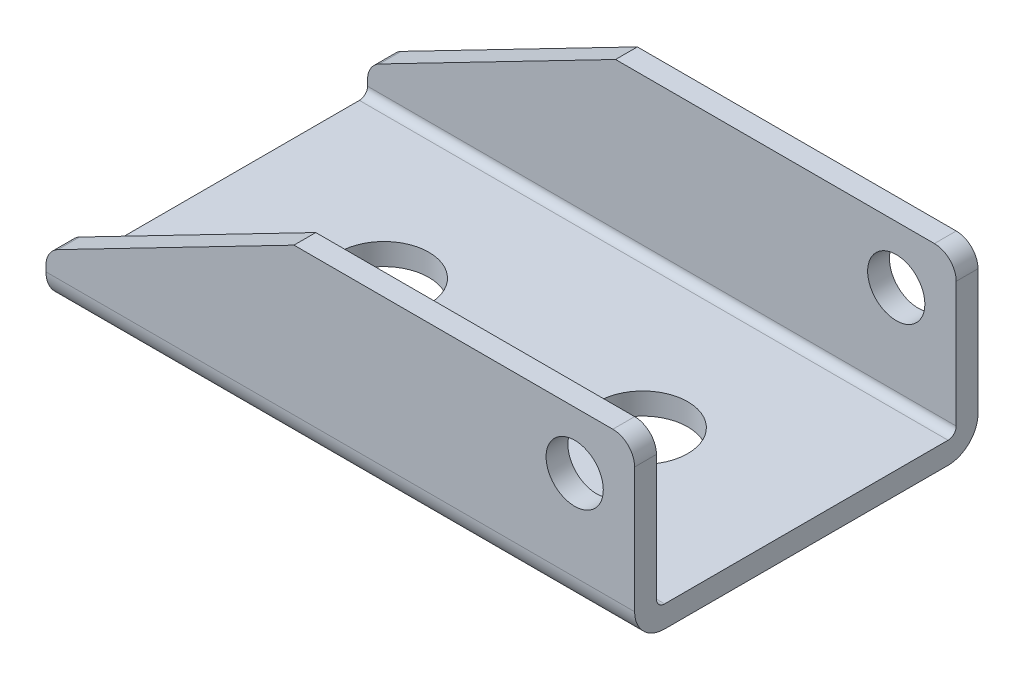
ISO-10303-21;
HEADER;
FILE_DESCRIPTION(('STEP AP214'),'2;1');
FILE_NAME('part.step','',(''),(''),'','','');
FILE_SCHEMA(('AUTOMOTIVE_DESIGN { 1 0 10303 214 1 1 1 1 }'));
ENDSEC;
DATA;
#1=APPLICATION_CONTEXT('core data for automotive mechanical design processes');
#2=APPLICATION_PROTOCOL_DEFINITION('international standard','automotive_design',2000,#1);
#3=PRODUCT_CONTEXT('',#1,'mechanical');
#4=PRODUCT('Part','Part','',(#3));
#5=PRODUCT_RELATED_PRODUCT_CATEGORY('part','',(#4));
#6=PRODUCT_DEFINITION_FORMATION('','',#4);
#7=PRODUCT_DEFINITION_CONTEXT('part definition',#1,'design');
#8=PRODUCT_DEFINITION('design','',#6,#7);
#9=PRODUCT_DEFINITION_SHAPE('','',#8);
#10=(LENGTH_UNIT() NAMED_UNIT(*) SI_UNIT(.MILLI.,.METRE.));
#11=(NAMED_UNIT(*) PLANE_ANGLE_UNIT() SI_UNIT($,.RADIAN.));
#12=(NAMED_UNIT(*) SI_UNIT($,.STERADIAN.) SOLID_ANGLE_UNIT());
#13=UNCERTAINTY_MEASURE_WITH_UNIT(LENGTH_MEASURE(1.E-05),#10,'distance_accuracy_value','');
#14=(GEOMETRIC_REPRESENTATION_CONTEXT(3) GLOBAL_UNCERTAINTY_ASSIGNED_CONTEXT((#13)) GLOBAL_UNIT_ASSIGNED_CONTEXT((#10,
#11,#12)) REPRESENTATION_CONTEXT('',''));
#15=CARTESIAN_POINT('',(0.,0.,0.));
#16=DIRECTION('',(0.,0.,1.));
#17=DIRECTION('',(1.,0.,0.));
#18=AXIS2_PLACEMENT_3D('',#15,#16,#17);
#19=CARTESIAN_POINT('',(-19.8859883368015,12.8779958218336,-6.30000000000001));
#20=DIRECTION('',(-0.458891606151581,0.888492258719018,0.));
#21=DIRECTION('',(-0.888492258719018,-0.458891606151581,0.));
#22=AXIS2_PLACEMENT_3D('',#19,#20,#21);
#23=PLANE('',#22);
#24=DIRECTION('',(0.,0.,-1.));
#25=VECTOR('',#24,1.);
#26=CARTESIAN_POINT('',(-28.5531016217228,8.40157467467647,0.));
#27=LINE('',#26,#25);
#28=CARTESIAN_POINT('',(-28.5531016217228,8.40157467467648,-5.50000000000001));
#29=VERTEX_POINT('',#28);
#30=CARTESIAN_POINT('',(-28.5531016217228,8.40157467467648,-6.30000000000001));
#31=VERTEX_POINT('',#30);
#32=EDGE_CURVE('E155',#29,#31,#27,.T.);
#33=ORIENTED_EDGE('',*,*,#32,.F.);
#34=DIRECTION('',(-0.888492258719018,-0.458891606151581,0.));
#35=VECTOR('',#34,1.);
#36=CARTESIAN_POINT('',(-19.8859883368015,12.8779958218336,-5.50000000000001));
#37=LINE('',#36,#35);
#38=CARTESIAN_POINT('',(-19.8859883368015,12.8779958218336,-5.50000000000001));
#39=VERTEX_POINT('',#38);
#40=EDGE_CURVE('E241',#29,#39,#37,.F.);
#41=ORIENTED_EDGE('',*,*,#40,.T.);
#42=DIRECTION('',(0.,0.,1.));
#43=VECTOR('',#42,1.);
#44=CARTESIAN_POINT('',(-19.8859883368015,12.8779958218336,0.));
#45=LINE('',#44,#43);
#46=CARTESIAN_POINT('',(-19.8859883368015,12.8779958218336,-6.30000000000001));
#47=VERTEX_POINT('',#46);
#48=EDGE_CURVE('E232',#47,#39,#45,.T.);
#49=ORIENTED_EDGE('',*,*,#48,.F.);
#50=DIRECTION('',(0.888492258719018,0.458891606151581,0.));
#51=VECTOR('',#50,1.);
#52=CARTESIAN_POINT('',(-28.5531016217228,8.40157467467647,-6.30000000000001));
#53=LINE('',#52,#51);
#54=EDGE_CURVE('E158',#31,#47,#53,.T.);
#55=ORIENTED_EDGE('',*,*,#54,.F.);
#56=EDGE_LOOP('',(#33,#41,#49,#55));
#57=FACE_BOUND('',#56,.T.);
#58=ADVANCED_FACE('F14',(#57),#23,.T.);
#59=CARTESIAN_POINT('',(-8.18598833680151,12.8779958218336,-6.30000000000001));
#60=DIRECTION('',(0.,1.,0.));
#61=DIRECTION('',(-1.,0.,0.));
#62=AXIS2_PLACEMENT_3D('',#59,#60,#61);
#63=PLANE('',#62);
#64=ORIENTED_EDGE('',*,*,#48,.T.);
#65=DIRECTION('',(1.,0.,0.));
#66=VECTOR('',#65,1.);
#67=CARTESIAN_POINT('',(-18.7364891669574,12.8779958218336,-5.50000000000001));
#68=LINE('',#67,#66);
#69=CARTESIAN_POINT('',(-8.18598833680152,12.8779958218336,-5.50000000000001));
#70=VERTEX_POINT('',#69);
#71=EDGE_CURVE('E289',#39,#70,#68,.T.);
#72=ORIENTED_EDGE('',*,*,#71,.T.);
#73=DIRECTION('',(0.,0.,1.));
#74=VECTOR('',#73,1.);
#75=CARTESIAN_POINT('',(-8.18598833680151,12.8779958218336,0.));
#76=LINE('',#75,#74);
#77=CARTESIAN_POINT('',(-8.18598833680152,12.8779958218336,-6.30000000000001));
#78=VERTEX_POINT('',#77);
#79=EDGE_CURVE('E239',#78,#70,#76,.T.);
#80=ORIENTED_EDGE('',*,*,#79,.F.);
#81=DIRECTION('',(1.,0.,0.));
#82=VECTOR('',#81,1.);
#83=CARTESIAN_POINT('',(-18.1859885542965,12.8779958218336,-6.30000000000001));
#84=LINE('',#83,#82);
#85=EDGE_CURVE('E223',#47,#78,#84,.T.);
#86=ORIENTED_EDGE('',*,*,#85,.F.);
#87=EDGE_LOOP('',(#64,#72,#80,#86));
#88=FACE_BOUND('',#87,.T.);
#89=ADVANCED_FACE('F429',(#88),#63,.T.);
#90=CARTESIAN_POINT('',(-9.58598833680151,10.7779958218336,-6.30000000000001));
#91=DIRECTION('',(0.,0.,1.));
#92=DIRECTION('',(1.,0.,0.));
#93=AXIS2_PLACEMENT_3D('',#90,#91,#92);
#94=CYLINDRICAL_SURFACE('',#93,1.05);
#95=CARTESIAN_POINT('',(-9.58598833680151,10.7779958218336,-6.30000000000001));
#96=DIRECTION('',(0.,0.,1.));
#97=DIRECTION('',(1.,0.,0.));
#98=AXIS2_PLACEMENT_3D('',#95,#96,#97);
#99=CIRCLE('',#98,1.05);
#100=CARTESIAN_POINT('',(-8.53598833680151,10.7779958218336,-6.30000000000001));
#101=VERTEX_POINT('',#100);
#102=EDGE_CURVE('E222',#101,#101,#99,.T.);
#103=ORIENTED_EDGE('',*,*,#102,.F.);
#104=EDGE_LOOP('',(#103));
#105=FACE_BOUND('',#104,.T.);
#106=CARTESIAN_POINT('',(-9.58598833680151,10.7779958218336,-5.50000000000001));
#107=DIRECTION('',(0.,0.,1.));
#108=DIRECTION('',(1.,0.,0.));
#109=AXIS2_PLACEMENT_3D('',#106,#107,#108);
#110=CIRCLE('',#109,1.05);
#111=CARTESIAN_POINT('',(-8.53598833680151,10.7779958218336,-5.50000000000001));
#112=VERTEX_POINT('',#111);
#113=EDGE_CURVE('E236',#112,#112,#110,.T.);
#114=ORIENTED_EDGE('',*,*,#113,.T.);
#115=EDGE_LOOP('',(#114));
#116=FACE_BOUND('',#115,.T.);
#117=ADVANCED_FACE('F426',(#105,#116),#94,.F.);
#118=CARTESIAN_POINT('',(-19.8859883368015,12.8779958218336,-6.30000000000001));
#119=DIRECTION('',(-0.458891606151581,0.888492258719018,0.));
#120=DIRECTION('',(-0.888492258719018,-0.458891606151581,0.));
#121=AXIS2_PLACEMENT_3D('',#118,#119,#120);
#122=PLANE('',#121);
#123=DIRECTION('',(0.,0.,1.));
#124=VECTOR('',#123,1.);
#125=CARTESIAN_POINT('',(-19.8859883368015,12.8779958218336,0.));
#126=LINE('',#125,#124);
#127=CARTESIAN_POINT('',(-19.8859883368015,12.8779958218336,5.5));
#128=VERTEX_POINT('',#127);
#129=CARTESIAN_POINT('',(-19.8859883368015,12.8779958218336,6.3));
#130=VERTEX_POINT('',#129);
#131=EDGE_CURVE('E229',#128,#130,#126,.T.);
#132=ORIENTED_EDGE('',*,*,#131,.F.);
#133=DIRECTION('',(-0.888492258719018,-0.458891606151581,0.));
#134=VECTOR('',#133,1.);
#135=CARTESIAN_POINT('',(-19.8859883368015,12.8779958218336,5.5));
#136=LINE('',#135,#134);
#137=CARTESIAN_POINT('',(-28.5531016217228,8.40157467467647,5.49999999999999));
#138=VERTEX_POINT('',#137);
#139=EDGE_CURVE('E214',#128,#138,#136,.T.);
#140=ORIENTED_EDGE('',*,*,#139,.T.);
#141=DIRECTION('',(0.,0.,-1.));
#142=VECTOR('',#141,1.);
#143=CARTESIAN_POINT('',(-28.5531016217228,8.40157467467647,0.));
#144=LINE('',#143,#142);
#145=CARTESIAN_POINT('',(-28.5531016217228,8.40157467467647,6.29999999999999));
#146=VERTEX_POINT('',#145);
#147=EDGE_CURVE('E231',#146,#138,#144,.T.);
#148=ORIENTED_EDGE('',*,*,#147,.F.);
#149=DIRECTION('',(-0.888492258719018,-0.458891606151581,0.));
#150=VECTOR('',#149,1.);
#151=CARTESIAN_POINT('',(-19.8859883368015,12.8779958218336,6.3));
#152=LINE('',#151,#150);
#153=EDGE_CURVE('E277',#130,#146,#152,.T.);
#154=ORIENTED_EDGE('',*,*,#153,.F.);
#155=EDGE_LOOP('',(#132,#140,#148,#154));
#156=FACE_BOUND('',#155,.T.);
#157=ADVANCED_FACE('F327',(#156),#122,.T.);
#158=CARTESIAN_POINT('',(-8.18598833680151,12.8779958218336,-6.30000000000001));
#159=DIRECTION('',(0.,1.,0.));
#160=DIRECTION('',(-1.,0.,0.));
#161=AXIS2_PLACEMENT_3D('',#158,#159,#160);
#162=PLANE('',#161);
#163=DIRECTION('',(0.,0.,1.));
#164=VECTOR('',#163,1.);
#165=CARTESIAN_POINT('',(-8.18598833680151,12.8779958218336,0.));
#166=LINE('',#165,#164);
#167=CARTESIAN_POINT('',(-8.18598833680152,12.8779958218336,5.49999999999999));
#168=VERTEX_POINT('',#167);
#169=CARTESIAN_POINT('',(-8.18598833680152,12.8779958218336,6.29999999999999));
#170=VERTEX_POINT('',#169);
#171=EDGE_CURVE('E233',#168,#170,#166,.T.);
#172=ORIENTED_EDGE('',*,*,#171,.F.);
#173=DIRECTION('',(-1.,0.,0.));
#174=VECTOR('',#173,1.);
#175=CARTESIAN_POINT('',(-18.7364891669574,12.8779958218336,5.49999999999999));
#176=LINE('',#175,#174);
#177=EDGE_CURVE('E264',#168,#128,#176,.T.);
#178=ORIENTED_EDGE('',*,*,#177,.T.);
#179=ORIENTED_EDGE('',*,*,#131,.T.);
#180=DIRECTION('',(-1.,0.,0.));
#181=VECTOR('',#180,1.);
#182=CARTESIAN_POINT('',(-18.1859885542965,12.8779958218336,6.3));
#183=LINE('',#182,#181);
#184=EDGE_CURVE('E279',#170,#130,#183,.T.);
#185=ORIENTED_EDGE('',*,*,#184,.F.);
#186=EDGE_LOOP('',(#172,#178,#179,#185));
#187=FACE_BOUND('',#186,.T.);
#188=ADVANCED_FACE('F306',(#187),#162,.T.);
#189=CARTESIAN_POINT('',(-9.58598833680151,10.7779958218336,-6.30000000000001));
#190=DIRECTION('',(0.,0.,1.));
#191=DIRECTION('',(1.,0.,0.));
#192=AXIS2_PLACEMENT_3D('',#189,#190,#191);
#193=CYLINDRICAL_SURFACE('',#192,1.05);
#194=CARTESIAN_POINT('',(-9.58598833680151,10.7779958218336,6.29999999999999));
#195=DIRECTION('',(0.,0.,1.));
#196=DIRECTION('',(1.,0.,0.));
#197=AXIS2_PLACEMENT_3D('',#194,#195,#196);
#198=CIRCLE('',#197,1.05);
#199=CARTESIAN_POINT('',(-8.53598833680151,10.7779958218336,6.29999999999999));
#200=VERTEX_POINT('',#199);
#201=EDGE_CURVE('E215',#200,#200,#198,.F.);
#202=ORIENTED_EDGE('',*,*,#201,.F.);
#203=EDGE_LOOP('',(#202));
#204=FACE_BOUND('',#203,.T.);
#205=CARTESIAN_POINT('',(-9.58598833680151,10.7779958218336,5.49999999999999));
#206=DIRECTION('',(0.,0.,1.));
#207=DIRECTION('',(1.,0.,0.));
#208=AXIS2_PLACEMENT_3D('',#205,#206,#207);
#209=CIRCLE('',#208,1.05);
#210=CARTESIAN_POINT('',(-8.53598833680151,10.7779958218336,5.49999999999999));
#211=VERTEX_POINT('',#210);
#212=EDGE_CURVE('E226',#211,#211,#209,.F.);
#213=ORIENTED_EDGE('',*,*,#212,.T.);
#214=EDGE_LOOP('',(#213));
#215=FACE_BOUND('',#214,.T.);
#216=ADVANCED_FACE('F418',(#204,#215),#193,.F.);
#217=CARTESIAN_POINT('',(-28.1859883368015,7.69078086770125,-6.3));
#218=DIRECTION('',(0.,0.,1.));
#219=DIRECTION('',(1.,0.,0.));
#220=AXIS2_PLACEMENT_3D('',#217,#218,#219);
#221=CYLINDRICAL_SURFACE('',#220,0.800000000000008);
#222=ORIENTED_EDGE('',*,*,#147,.T.);
#223=CARTESIAN_POINT('',(-28.1859883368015,7.69078086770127,5.49999999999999));
#224=DIRECTION('',(0.,0.,1.));
#225=DIRECTION('',(1.,0.,0.));
#226=AXIS2_PLACEMENT_3D('',#223,#224,#225);
#227=CIRCLE('',#226,0.800000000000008);
#228=CARTESIAN_POINT('',(-28.9859883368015,7.69078086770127,5.49999999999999));
#229=VERTEX_POINT('',#228);
#230=EDGE_CURVE('E268',#138,#229,#227,.T.);
#231=ORIENTED_EDGE('',*,*,#230,.T.);
#232=DIRECTION('',(0.,0.,-1.));
#233=VECTOR('',#232,1.);
#234=CARTESIAN_POINT('',(-28.9859883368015,7.69078086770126,0.));
#235=LINE('',#234,#233);
#236=CARTESIAN_POINT('',(-28.9859883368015,7.69078086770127,6.29999999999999));
#237=VERTEX_POINT('',#236);
#238=EDGE_CURVE('E173',#237,#229,#235,.T.);
#239=ORIENTED_EDGE('',*,*,#238,.F.);
#240=CARTESIAN_POINT('',(-28.1859883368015,7.69078086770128,6.3));
#241=DIRECTION('',(0.,0.,1.));
#242=DIRECTION('',(1.,0.,0.));
#243=AXIS2_PLACEMENT_3D('',#240,#241,#242);
#244=CIRCLE('',#243,0.800000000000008);
#245=EDGE_CURVE('E275',#146,#237,#244,.T.);
#246=ORIENTED_EDGE('',*,*,#245,.F.);
#247=EDGE_LOOP('',(#222,#231,#239,#246));
#248=FACE_BOUND('',#247,.T.);
#249=ADVANCED_FACE('F415',(#248),#221,.T.);
#250=CARTESIAN_POINT('',(-28.1859883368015,7.69078086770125,-6.3));
#251=DIRECTION('',(0.,0.,1.));
#252=DIRECTION('',(1.,0.,0.));
#253=AXIS2_PLACEMENT_3D('',#250,#251,#252);
#254=CYLINDRICAL_SURFACE('',#253,0.800000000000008);
#255=DIRECTION('',(0.,0.,-1.));
#256=VECTOR('',#255,1.);
#257=CARTESIAN_POINT('',(-28.9859883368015,7.69078086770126,0.));
#258=LINE('',#257,#256);
#259=CARTESIAN_POINT('',(-28.9859883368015,7.69078086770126,-5.50000000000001));
#260=VERTEX_POINT('',#259);
#261=CARTESIAN_POINT('',(-28.9859883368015,7.69078086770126,-6.30000000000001));
#262=VERTEX_POINT('',#261);
#263=EDGE_CURVE('E139',#260,#262,#258,.T.);
#264=ORIENTED_EDGE('',*,*,#263,.F.);
#265=CARTESIAN_POINT('',(-28.1859883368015,7.69078086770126,-5.5));
#266=DIRECTION('',(0.,0.,1.));
#267=DIRECTION('',(1.,0.,0.));
#268=AXIS2_PLACEMENT_3D('',#265,#266,#267);
#269=CIRCLE('',#268,0.800000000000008);
#270=EDGE_CURVE('E284',#260,#29,#269,.F.);
#271=ORIENTED_EDGE('',*,*,#270,.T.);
#272=ORIENTED_EDGE('',*,*,#32,.T.);
#273=CARTESIAN_POINT('',(-28.1859883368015,7.69078086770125,-6.3));
#274=DIRECTION('',(0.,0.,1.));
#275=DIRECTION('',(1.,0.,0.));
#276=AXIS2_PLACEMENT_3D('',#273,#274,#275);
#277=CIRCLE('',#276,0.800000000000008);
#278=EDGE_CURVE('E18',#262,#31,#277,.F.);
#279=ORIENTED_EDGE('',*,*,#278,.F.);
#280=EDGE_LOOP('',(#264,#271,#272,#279));
#281=FACE_BOUND('',#280,.T.);
#282=ADVANCED_FACE('F153',(#281),#254,.T.);
#283=CARTESIAN_POINT('',(-7.38598833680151,7.47799582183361,-5.20000000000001));
#284=DIRECTION('',(-1.,0.,0.));
#285=DIRECTION('',(0.,-1.,0.));
#286=AXIS2_PLACEMENT_3D('',#283,#284,#285);
#287=CYLINDRICAL_SURFACE('',#286,1.1);
#288=DIRECTION('',(-1.,0.,0.));
#289=VECTOR('',#288,1.);
#290=CARTESIAN_POINT('',(-18.1859885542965,7.47799582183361,-6.30000000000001));
#291=LINE('',#290,#289);
#292=CARTESIAN_POINT('',(-7.38598833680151,7.47799582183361,-6.30000000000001));
#293=VERTEX_POINT('',#292);
#294=CARTESIAN_POINT('',(-28.9859883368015,7.47799582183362,-6.30000000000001));
#295=VERTEX_POINT('',#294);
#296=EDGE_CURVE('E162',#293,#295,#291,.T.);
#297=ORIENTED_EDGE('',*,*,#296,.F.);
#298=CARTESIAN_POINT('',(-7.38598833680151,7.47799582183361,-5.20000000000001));
#299=DIRECTION('',(1.,0.,0.));
#300=DIRECTION('',(0.,0.,-1.));
#301=AXIS2_PLACEMENT_3D('',#298,#299,#300);
#302=CIRCLE('',#301,1.1);
#303=CARTESIAN_POINT('',(-7.38598833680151,6.37799582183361,-5.20000000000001));
#304=VERTEX_POINT('',#303);
#305=EDGE_CURVE('E191',#304,#293,#302,.T.);
#306=ORIENTED_EDGE('',*,*,#305,.F.);
#307=DIRECTION('',(1.,0.,0.));
#308=VECTOR('',#307,1.);
#309=CARTESIAN_POINT('',(-18.1859883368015,6.37799582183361,-5.2));
#310=LINE('',#309,#308);
#311=CARTESIAN_POINT('',(-28.9859883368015,6.37799582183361,-5.2));
#312=VERTEX_POINT('',#311);
#313=EDGE_CURVE('E225',#312,#304,#310,.T.);
#314=ORIENTED_EDGE('',*,*,#313,.F.);
#315=CARTESIAN_POINT('',(-28.9859883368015,7.47799582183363,-5.19999999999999));
#316=DIRECTION('',(-1.,0.,0.));
#317=DIRECTION('',(0.,0.,1.));
#318=AXIS2_PLACEMENT_3D('',#315,#316,#317);
#319=CIRCLE('',#318,1.1);
#320=EDGE_CURVE('E163',#295,#312,#319,.T.);
#321=ORIENTED_EDGE('',*,*,#320,.F.);
#322=EDGE_LOOP('',(#297,#306,#314,#321));
#323=FACE_BOUND('',#322,.T.);
#324=ADVANCED_FACE('F344',(#323),#287,.T.);
#325=CARTESIAN_POINT('',(-29.5259873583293,13.0404958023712,-6.30000000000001));
#326=DIRECTION('',(0.,0.,-1.));
#327=DIRECTION('',(1.,0.,0.));
#328=AXIS2_PLACEMENT_3D('',#325,#326,#327);
#329=PLANE('',#328);
#330=ORIENTED_EDGE('',*,*,#102,.T.);
#331=EDGE_LOOP('',(#330));
#332=FACE_BOUND('',#331,.T.);
#333=DIRECTION('',(0.,1.,0.));
#334=VECTOR('',#333,1.);
#335=CARTESIAN_POINT('',(-7.38598833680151,9.22799582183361,-6.30000000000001));
#336=LINE('',#335,#334);
#337=CARTESIAN_POINT('',(-7.38598833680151,12.0779958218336,-6.30000000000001));
#338=VERTEX_POINT('',#337);
#339=EDGE_CURVE('E189',#293,#338,#336,.T.);
#340=ORIENTED_EDGE('',*,*,#339,.F.);
#341=ORIENTED_EDGE('',*,*,#296,.T.);
#342=DIRECTION('',(0.,-1.,0.));
#343=VECTOR('',#342,1.);
#344=CARTESIAN_POINT('',(-28.9859883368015,7.03438834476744,-6.30000000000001));
#345=LINE('',#344,#343);
#346=EDGE_CURVE('E144',#262,#295,#345,.T.);
#347=ORIENTED_EDGE('',*,*,#346,.F.);
#348=ORIENTED_EDGE('',*,*,#278,.T.);
#349=ORIENTED_EDGE('',*,*,#54,.T.);
#350=ORIENTED_EDGE('',*,*,#85,.T.);
#351=CARTESIAN_POINT('',(-8.18598833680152,12.0779958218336,-6.30000000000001));
#352=DIRECTION('',(0.,0.,1.));
#353=DIRECTION('',(1.,0.,0.));
#354=AXIS2_PLACEMENT_3D('',#351,#352,#353);
#355=CIRCLE('',#354,0.800000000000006);
#356=EDGE_CURVE('E242',#338,#78,#355,.T.);
#357=ORIENTED_EDGE('',*,*,#356,.F.);
#358=EDGE_LOOP('',(#340,#341,#347,#348,#349,#350,#357));
#359=FACE_BOUND('',#358,.T.);
#360=ADVANCED_FACE('F160',(#332,#359),#329,.T.);
#361=CARTESIAN_POINT('',(-8.18598833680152,12.0779958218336,-6.30000000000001));
#362=DIRECTION('',(0.,0.,1.));
#363=DIRECTION('',(1.,0.,0.));
#364=AXIS2_PLACEMENT_3D('',#361,#362,#363);
#365=CYLINDRICAL_SURFACE('',#364,0.800000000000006);
#366=ORIENTED_EDGE('',*,*,#79,.T.);
#367=CARTESIAN_POINT('',(-8.18598833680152,12.0779958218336,-5.50000000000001));
#368=DIRECTION('',(0.,0.,1.));
#369=DIRECTION('',(1.,0.,0.));
#370=AXIS2_PLACEMENT_3D('',#367,#368,#369);
#371=CIRCLE('',#370,0.800000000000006);
#372=CARTESIAN_POINT('',(-7.38598833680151,12.0779958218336,-5.50000000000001));
#373=VERTEX_POINT('',#372);
#374=EDGE_CURVE('E286',#70,#373,#371,.F.);
#375=ORIENTED_EDGE('',*,*,#374,.T.);
#376=DIRECTION('',(0.,0.,1.));
#377=VECTOR('',#376,1.);
#378=CARTESIAN_POINT('',(-7.38598833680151,12.0779958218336,0.));
#379=LINE('',#378,#377);
#380=EDGE_CURVE('E188',#338,#373,#379,.T.);
#381=ORIENTED_EDGE('',*,*,#380,.F.);
#382=ORIENTED_EDGE('',*,*,#356,.T.);
#383=EDGE_LOOP('',(#366,#375,#381,#382));
#384=FACE_BOUND('',#383,.T.);
#385=ADVANCED_FACE('F348',(#384),#365,.T.);
#386=CARTESIAN_POINT('',(-7.38598833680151,13.8779958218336,-5.50000000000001));
#387=DIRECTION('',(0.,0.,-1.));
#388=DIRECTION('',(0.,-1.,0.));
#389=AXIS2_PLACEMENT_3D('',#386,#387,#388);
#390=PLANE('',#389);
#391=ORIENTED_EDGE('',*,*,#113,.F.);
#392=EDGE_LOOP('',(#391));
#393=FACE_BOUND('',#392,.T.);
#394=DIRECTION('',(0.,1.,0.));
#395=VECTOR('',#394,1.);
#396=CARTESIAN_POINT('',(-28.9859883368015,7.03438834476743,-5.50000000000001));
#397=LINE('',#396,#395);
#398=CARTESIAN_POINT('',(-28.9859883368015,7.47799582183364,-5.50000000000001));
#399=VERTEX_POINT('',#398);
#400=EDGE_CURVE('E147',#399,#260,#397,.T.);
#401=ORIENTED_EDGE('',*,*,#400,.F.);
#402=DIRECTION('',(1.,0.,0.));
#403=VECTOR('',#402,1.);
#404=CARTESIAN_POINT('',(-18.7364891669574,7.47799582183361,-5.50000000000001));
#405=LINE('',#404,#403);
#406=CARTESIAN_POINT('',(-7.38598833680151,7.47799582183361,-5.50000000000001));
#407=VERTEX_POINT('',#406);
#408=EDGE_CURVE('E195',#399,#407,#405,.T.);
#409=ORIENTED_EDGE('',*,*,#408,.T.);
#410=DIRECTION('',(0.,-1.,0.));
#411=VECTOR('',#410,1.);
#412=CARTESIAN_POINT('',(-7.38598833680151,9.22799582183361,-5.50000000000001));
#413=LINE('',#412,#411);
#414=EDGE_CURVE('E186',#373,#407,#413,.T.);
#415=ORIENTED_EDGE('',*,*,#414,.F.);
#416=ORIENTED_EDGE('',*,*,#374,.F.);
#417=ORIENTED_EDGE('',*,*,#71,.F.);
#418=ORIENTED_EDGE('',*,*,#40,.F.);
#419=ORIENTED_EDGE('',*,*,#270,.F.);
#420=EDGE_LOOP('',(#401,#409,#415,#416,#417,#418,#419));
#421=FACE_BOUND('',#420,.T.);
#422=ADVANCED_FACE('F353',(#393,#421),#390,.F.);
#423=CARTESIAN_POINT('',(-8.18598833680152,12.0779958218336,-6.30000000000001));
#424=DIRECTION('',(0.,0.,1.));
#425=DIRECTION('',(1.,0.,0.));
#426=AXIS2_PLACEMENT_3D('',#423,#424,#425);
#427=CYLINDRICAL_SURFACE('',#426,0.800000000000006);
#428=DIRECTION('',(0.,0.,1.));
#429=VECTOR('',#428,1.);
#430=CARTESIAN_POINT('',(-7.38598833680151,12.0779958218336,0.));
#431=LINE('',#430,#429);
#432=CARTESIAN_POINT('',(-7.38598833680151,12.0779958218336,5.49999999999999));
#433=VERTEX_POINT('',#432);
#434=CARTESIAN_POINT('',(-7.38598833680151,12.0779958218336,6.29999999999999));
#435=VERTEX_POINT('',#434);
#436=EDGE_CURVE('E181',#433,#435,#431,.T.);
#437=ORIENTED_EDGE('',*,*,#436,.F.);
#438=CARTESIAN_POINT('',(-8.18598833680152,12.0779958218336,5.49999999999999));
#439=DIRECTION('',(0.,0.,1.));
#440=DIRECTION('',(1.,0.,0.));
#441=AXIS2_PLACEMENT_3D('',#438,#439,#440);
#442=CIRCLE('',#441,0.800000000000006);
#443=EDGE_CURVE('E265',#433,#168,#442,.T.);
#444=ORIENTED_EDGE('',*,*,#443,.T.);
#445=ORIENTED_EDGE('',*,*,#171,.T.);
#446=CARTESIAN_POINT('',(-8.18598833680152,12.0779958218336,6.29999999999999));
#447=DIRECTION('',(0.,0.,1.));
#448=DIRECTION('',(1.,0.,0.));
#449=AXIS2_PLACEMENT_3D('',#446,#447,#448);
#450=CIRCLE('',#449,0.800000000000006);
#451=EDGE_CURVE('E235',#435,#170,#450,.T.);
#452=ORIENTED_EDGE('',*,*,#451,.F.);
#453=EDGE_LOOP('',(#437,#444,#445,#452));
#454=FACE_BOUND('',#453,.T.);
#455=ADVANCED_FACE('F314',(#454),#427,.T.);
#456=CARTESIAN_POINT('',(-6.84598975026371,6.21549598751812,6.3));
#457=DIRECTION('',(0.,0.,1.));
#458=DIRECTION('',(0.,1.,0.));
#459=AXIS2_PLACEMENT_3D('',#456,#457,#458);
#460=PLANE('',#459);
#461=ORIENTED_EDGE('',*,*,#201,.T.);
#462=EDGE_LOOP('',(#461));
#463=FACE_BOUND('',#462,.T.);
#464=DIRECTION('',(0.,1.,0.));
#465=VECTOR('',#464,1.);
#466=CARTESIAN_POINT('',(-28.9859883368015,7.03438834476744,6.3));
#467=LINE('',#466,#465);
#468=CARTESIAN_POINT('',(-28.9859883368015,7.47799582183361,6.3));
#469=VERTEX_POINT('',#468);
#470=EDGE_CURVE('E174',#469,#237,#467,.T.);
#471=ORIENTED_EDGE('',*,*,#470,.F.);
#472=DIRECTION('',(-1.,0.,0.));
#473=VECTOR('',#472,1.);
#474=CARTESIAN_POINT('',(-18.1859883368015,7.47799582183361,6.3));
#475=LINE('',#474,#473);
#476=CARTESIAN_POINT('',(-7.38598833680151,7.47799582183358,6.3));
#477=VERTEX_POINT('',#476);
#478=EDGE_CURVE('E212',#477,#469,#475,.T.);
#479=ORIENTED_EDGE('',*,*,#478,.F.);
#480=DIRECTION('',(0.,-1.,0.));
#481=VECTOR('',#480,1.);
#482=CARTESIAN_POINT('',(-7.38598833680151,9.22799582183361,6.3));
#483=LINE('',#482,#481);
#484=EDGE_CURVE('E178',#435,#477,#483,.T.);
#485=ORIENTED_EDGE('',*,*,#484,.F.);
#486=ORIENTED_EDGE('',*,*,#451,.T.);
#487=ORIENTED_EDGE('',*,*,#184,.T.);
#488=ORIENTED_EDGE('',*,*,#153,.T.);
#489=ORIENTED_EDGE('',*,*,#245,.T.);
#490=EDGE_LOOP('',(#471,#479,#485,#486,#487,#488,#489));
#491=FACE_BOUND('',#490,.T.);
#492=ADVANCED_FACE('F332',(#463,#491),#460,.T.);
#493=CARTESIAN_POINT('',(-28.9859883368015,7.47799582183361,5.19999999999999));
#494=DIRECTION('',(1.,0.,0.));
#495=DIRECTION('',(0.,1.,0.));
#496=AXIS2_PLACEMENT_3D('',#493,#494,#495);
#497=CYLINDRICAL_SURFACE('',#496,1.1);
#498=ORIENTED_EDGE('',*,*,#478,.T.);
#499=CARTESIAN_POINT('',(-28.9859883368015,7.47799582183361,5.19999999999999));
#500=DIRECTION('',(-1.,0.,0.));
#501=DIRECTION('',(0.,0.,1.));
#502=AXIS2_PLACEMENT_3D('',#499,#500,#501);
#503=CIRCLE('',#502,1.1);
#504=CARTESIAN_POINT('',(-28.9859883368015,6.37799582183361,5.19999999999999));
#505=VERTEX_POINT('',#504);
#506=EDGE_CURVE('E259',#505,#469,#503,.T.);
#507=ORIENTED_EDGE('',*,*,#506,.F.);
#508=DIRECTION('',(-1.,0.,0.));
#509=VECTOR('',#508,1.);
#510=CARTESIAN_POINT('',(-18.1859883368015,6.37799582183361,5.19999999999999));
#511=LINE('',#510,#509);
#512=CARTESIAN_POINT('',(-7.38598833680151,6.37799582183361,5.20000000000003));
#513=VERTEX_POINT('',#512);
#514=EDGE_CURVE('E177',#513,#505,#511,.T.);
#515=ORIENTED_EDGE('',*,*,#514,.F.);
#516=CARTESIAN_POINT('',(-7.38598833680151,7.47799582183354,5.20000000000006));
#517=DIRECTION('',(1.,0.,0.));
#518=DIRECTION('',(0.,0.,-1.));
#519=AXIS2_PLACEMENT_3D('',#516,#517,#518);
#520=CIRCLE('',#519,1.1);
#521=EDGE_CURVE('E180',#477,#513,#520,.T.);
#522=ORIENTED_EDGE('',*,*,#521,.F.);
#523=EDGE_LOOP('',(#498,#507,#515,#522));
#524=FACE_BOUND('',#523,.T.);
#525=ADVANCED_FACE('F336',(#524),#497,.T.);
#526=CARTESIAN_POINT('',(-7.38598833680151,7.47799582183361,5.49999999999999));
#527=DIRECTION('',(0.,0.,1.));
#528=DIRECTION('',(0.,1.,0.));
#529=AXIS2_PLACEMENT_3D('',#526,#527,#528);
#530=PLANE('',#529);
#531=ORIENTED_EDGE('',*,*,#212,.F.);
#532=EDGE_LOOP('',(#531));
#533=FACE_BOUND('',#532,.T.);
#534=ORIENTED_EDGE('',*,*,#443,.F.);
#535=DIRECTION('',(0.,1.,0.));
#536=VECTOR('',#535,1.);
#537=CARTESIAN_POINT('',(-7.38598833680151,9.22799582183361,5.49999999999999));
#538=LINE('',#537,#536);
#539=CARTESIAN_POINT('',(-7.38598833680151,7.47799582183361,5.49999999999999));
#540=VERTEX_POINT('',#539);
#541=EDGE_CURVE('E182',#540,#433,#538,.T.);
#542=ORIENTED_EDGE('',*,*,#541,.F.);
#543=DIRECTION('',(-1.,0.,0.));
#544=VECTOR('',#543,1.);
#545=CARTESIAN_POINT('',(-18.7364891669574,7.47799582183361,5.49999999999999));
#546=LINE('',#545,#544);
#547=CARTESIAN_POINT('',(-28.9859883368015,7.47799582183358,5.49999999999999));
#548=VERTEX_POINT('',#547);
#549=EDGE_CURVE('E208',#540,#548,#546,.T.);
#550=ORIENTED_EDGE('',*,*,#549,.T.);
#551=DIRECTION('',(0.,-1.,0.));
#552=VECTOR('',#551,1.);
#553=CARTESIAN_POINT('',(-28.9859883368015,7.03438834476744,5.49999999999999));
#554=LINE('',#553,#552);
#555=EDGE_CURVE('E171',#229,#548,#554,.T.);
#556=ORIENTED_EDGE('',*,*,#555,.F.);
#557=ORIENTED_EDGE('',*,*,#230,.F.);
#558=ORIENTED_EDGE('',*,*,#139,.F.);
#559=ORIENTED_EDGE('',*,*,#177,.F.);
#560=EDGE_LOOP('',(#534,#542,#550,#556,#557,#558,#559));
#561=FACE_BOUND('',#560,.T.);
#562=ADVANCED_FACE('F310',(#533,#561),#530,.F.);
#563=CARTESIAN_POINT('',(-28.9859883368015,6.37799582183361,-6.30000000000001));
#564=DIRECTION('',(0.,-1.,0.));
#565=DIRECTION('',(1.,0.,0.));
#566=AXIS2_PLACEMENT_3D('',#563,#564,#565);
#567=PLANE('',#566);
#568=CARTESIAN_POINT('',(-13.3859883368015,6.37799582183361,0.));
#569=DIRECTION('',(0.,-1.,0.));
#570=DIRECTION('',(0.,0.,-1.));
#571=AXIS2_PLACEMENT_3D('',#568,#569,#570);
#572=CIRCLE('',#571,1.65);
#573=CARTESIAN_POINT('',(-13.3859883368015,6.37799582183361,-1.65));
#574=VERTEX_POINT('',#573);
#575=EDGE_CURVE('E207',#574,#574,#572,.F.);
#576=ORIENTED_EDGE('',*,*,#575,.T.);
#577=EDGE_LOOP('',(#576));
#578=FACE_BOUND('',#577,.T.);
#579=CARTESIAN_POINT('',(-22.8859883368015,6.37799582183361,0.));
#580=DIRECTION('',(0.,-1.,0.));
#581=DIRECTION('',(0.,0.,-1.));
#582=AXIS2_PLACEMENT_3D('',#579,#580,#581);
#583=CIRCLE('',#582,1.65);
#584=CARTESIAN_POINT('',(-22.8859883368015,6.37799582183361,-1.65000000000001));
#585=VERTEX_POINT('',#584);
#586=EDGE_CURVE('E211',#585,#585,#583,.F.);
#587=ORIENTED_EDGE('',*,*,#586,.T.);
#588=EDGE_LOOP('',(#587));
#589=FACE_BOUND('',#588,.T.);
#590=DIRECTION('',(0.,0.,-1.));
#591=VECTOR('',#590,1.);
#592=CARTESIAN_POINT('',(-7.38598833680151,6.37799582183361,0.));
#593=LINE('',#592,#591);
#594=EDGE_CURVE('E192',#513,#304,#593,.T.);
#595=ORIENTED_EDGE('',*,*,#594,.F.);
#596=ORIENTED_EDGE('',*,*,#514,.T.);
#597=DIRECTION('',(0.,0.,1.));
#598=VECTOR('',#597,1.);
#599=CARTESIAN_POINT('',(-28.9859883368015,6.37799582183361,0.));
#600=LINE('',#599,#598);
#601=EDGE_CURVE('E165',#312,#505,#600,.T.);
#602=ORIENTED_EDGE('',*,*,#601,.F.);
#603=ORIENTED_EDGE('',*,*,#313,.T.);
#604=EDGE_LOOP('',(#595,#596,#602,#603));
#605=FACE_BOUND('',#604,.T.);
#606=ADVANCED_FACE('F340',(#578,#589,#605),#567,.T.);
#607=CARTESIAN_POINT('',(-28.9859883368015,7.69078086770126,-6.30000000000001));
#608=DIRECTION('',(-1.,0.,0.));
#609=DIRECTION('',(0.,-1.,0.));
#610=AXIS2_PLACEMENT_3D('',#607,#608,#609);
#611=PLANE('',#610);
#612=ORIENTED_EDGE('',*,*,#601,.T.);
#613=ORIENTED_EDGE('',*,*,#506,.T.);
#614=ORIENTED_EDGE('',*,*,#470,.T.);
#615=ORIENTED_EDGE('',*,*,#238,.T.);
#616=ORIENTED_EDGE('',*,*,#555,.T.);
#617=CARTESIAN_POINT('',(-28.9859883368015,7.47799582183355,5.20000000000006));
#618=DIRECTION('',(-1.,0.,0.));
#619=DIRECTION('',(0.,-1.,0.));
#620=AXIS2_PLACEMENT_3D('',#617,#618,#619);
#621=CIRCLE('',#620,0.3);
#622=CARTESIAN_POINT('',(-28.9859883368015,7.17799582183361,5.20000000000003));
#623=VERTEX_POINT('',#622);
#624=EDGE_CURVE('E251',#548,#623,#621,.F.);
#625=ORIENTED_EDGE('',*,*,#624,.T.);
#626=DIRECTION('',(0.,0.,-1.));
#627=VECTOR('',#626,1.);
#628=CARTESIAN_POINT('',(-28.9859883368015,7.17799582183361,0.));
#629=LINE('',#628,#627);
#630=CARTESIAN_POINT('',(-28.9859883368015,7.17799582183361,-5.19999999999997));
#631=VERTEX_POINT('',#630);
#632=EDGE_CURVE('E200',#623,#631,#629,.T.);
#633=ORIENTED_EDGE('',*,*,#632,.T.);
#634=CARTESIAN_POINT('',(-28.9859883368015,7.47799582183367,-5.19999999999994));
#635=DIRECTION('',(-1.,0.,0.));
#636=DIRECTION('',(0.,-1.,0.));
#637=AXIS2_PLACEMENT_3D('',#634,#635,#636);
#638=CIRCLE('',#637,0.3);
#639=EDGE_CURVE('E219',#631,#399,#638,.F.);
#640=ORIENTED_EDGE('',*,*,#639,.T.);
#641=ORIENTED_EDGE('',*,*,#400,.T.);
#642=ORIENTED_EDGE('',*,*,#263,.T.);
#643=ORIENTED_EDGE('',*,*,#346,.T.);
#644=ORIENTED_EDGE('',*,*,#320,.T.);
#645=EDGE_LOOP('',(#612,#613,#614,#615,#616,#625,#633,#640,#641,#642,#643,#644));
#646=FACE_BOUND('',#645,.T.);
#647=ADVANCED_FACE('F142',(#646),#611,.T.);
#648=CARTESIAN_POINT('',(-7.38598833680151,7.47799582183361,-5.2));
#649=DIRECTION('',(-1.,0.,0.));
#650=DIRECTION('',(0.,-1.,0.));
#651=AXIS2_PLACEMENT_3D('',#648,#649,#650);
#652=CYLINDRICAL_SURFACE('',#651,0.3);
#653=CARTESIAN_POINT('',(-7.38598833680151,7.47799582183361,-5.2));
#654=DIRECTION('',(-1.,0.,0.));
#655=DIRECTION('',(0.,-1.,0.));
#656=AXIS2_PLACEMENT_3D('',#653,#654,#655);
#657=CIRCLE('',#656,0.3);
#658=CARTESIAN_POINT('',(-7.38598833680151,7.17799582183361,-5.2));
#659=VERTEX_POINT('',#658);
#660=EDGE_CURVE('E185',#407,#659,#657,.T.);
#661=ORIENTED_EDGE('',*,*,#660,.F.);
#662=ORIENTED_EDGE('',*,*,#408,.F.);
#663=ORIENTED_EDGE('',*,*,#639,.F.);
#664=DIRECTION('',(1.,0.,0.));
#665=VECTOR('',#664,1.);
#666=CARTESIAN_POINT('',(-18.7364891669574,7.17799582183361,-5.2));
#667=LINE('',#666,#665);
#668=EDGE_CURVE('E196',#631,#659,#667,.T.);
#669=ORIENTED_EDGE('',*,*,#668,.T.);
#670=EDGE_LOOP('',(#661,#662,#663,#669));
#671=FACE_BOUND('',#670,.T.);
#672=ADVANCED_FACE('F360',(#671),#652,.F.);
#673=CARTESIAN_POINT('',(-7.38598833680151,6.37799582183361,-6.30000000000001));
#674=DIRECTION('',(1.,0.,0.));
#675=DIRECTION('',(0.,1.,0.));
#676=AXIS2_PLACEMENT_3D('',#673,#674,#675);
#677=PLANE('',#676);
#678=ORIENTED_EDGE('',*,*,#484,.T.);
#679=ORIENTED_EDGE('',*,*,#521,.T.);
#680=ORIENTED_EDGE('',*,*,#594,.T.);
#681=ORIENTED_EDGE('',*,*,#305,.T.);
#682=ORIENTED_EDGE('',*,*,#339,.T.);
#683=ORIENTED_EDGE('',*,*,#380,.T.);
#684=ORIENTED_EDGE('',*,*,#414,.T.);
#685=ORIENTED_EDGE('',*,*,#660,.T.);
#686=DIRECTION('',(0.,0.,1.));
#687=VECTOR('',#686,1.);
#688=CARTESIAN_POINT('',(-7.38598833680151,7.17799582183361,0.));
#689=LINE('',#688,#687);
#690=CARTESIAN_POINT('',(-7.38598833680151,7.17799582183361,5.19999999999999));
#691=VERTEX_POINT('',#690);
#692=EDGE_CURVE('E199',#659,#691,#689,.T.);
#693=ORIENTED_EDGE('',*,*,#692,.T.);
#694=CARTESIAN_POINT('',(-7.38598833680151,7.47799582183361,5.19999999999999));
#695=DIRECTION('',(-1.,0.,0.));
#696=DIRECTION('',(0.,-1.,0.));
#697=AXIS2_PLACEMENT_3D('',#694,#695,#696);
#698=CIRCLE('',#697,0.3);
#699=EDGE_CURVE('E33',#691,#540,#698,.T.);
#700=ORIENTED_EDGE('',*,*,#699,.T.);
#701=ORIENTED_EDGE('',*,*,#541,.T.);
#702=ORIENTED_EDGE('',*,*,#436,.T.);
#703=EDGE_LOOP('',(#678,#679,#680,#681,#682,#683,#684,#685,#693,#700,#701,#702));
#704=FACE_BOUND('',#703,.T.);
#705=ADVANCED_FACE('F318',(#704),#677,.T.);
#706=CARTESIAN_POINT('',(-7.38598833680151,7.47799582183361,5.19999999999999));
#707=DIRECTION('',(-1.,0.,0.));
#708=DIRECTION('',(0.,-1.,0.));
#709=AXIS2_PLACEMENT_3D('',#706,#707,#708);
#710=CYLINDRICAL_SURFACE('',#709,0.3);
#711=ORIENTED_EDGE('',*,*,#699,.F.);
#712=DIRECTION('',(-1.,0.,0.));
#713=VECTOR('',#712,1.);
#714=CARTESIAN_POINT('',(-18.7364891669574,7.17799582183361,5.19999999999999));
#715=LINE('',#714,#713);
#716=EDGE_CURVE('E203',#691,#623,#715,.T.);
#717=ORIENTED_EDGE('',*,*,#716,.T.);
#718=ORIENTED_EDGE('',*,*,#624,.F.);
#719=ORIENTED_EDGE('',*,*,#549,.F.);
#720=EDGE_LOOP('',(#711,#717,#718,#719));
#721=FACE_BOUND('',#720,.T.);
#722=ADVANCED_FACE('F322',(#721),#710,.F.);
#723=CARTESIAN_POINT('',(-22.8859883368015,7.17799582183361,0.));
#724=DIRECTION('',(0.,-1.,0.));
#725=DIRECTION('',(0.,0.,-1.));
#726=AXIS2_PLACEMENT_3D('',#723,#724,#725);
#727=CYLINDRICAL_SURFACE('',#726,1.65);
#728=CARTESIAN_POINT('',(-22.8859883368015,7.17799582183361,0.));
#729=DIRECTION('',(0.,-1.,0.));
#730=DIRECTION('',(0.,0.,-1.));
#731=AXIS2_PLACEMENT_3D('',#728,#729,#730);
#732=CIRCLE('',#731,1.65);
#733=CARTESIAN_POINT('',(-22.8859883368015,7.17799582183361,-1.65000000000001));
#734=VERTEX_POINT('',#733);
#735=EDGE_CURVE('E24',#734,#734,#732,.F.);
#736=ORIENTED_EDGE('',*,*,#735,.T.);
#737=EDGE_LOOP('',(#736));
#738=FACE_BOUND('',#737,.T.);
#739=ORIENTED_EDGE('',*,*,#586,.F.);
#740=EDGE_LOOP('',(#739));
#741=FACE_BOUND('',#740,.T.);
#742=ADVANCED_FACE('F376',(#738,#741),#727,.F.);
#743=CARTESIAN_POINT('',(-13.3859883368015,7.17799582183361,0.));
#744=DIRECTION('',(0.,-1.,0.));
#745=DIRECTION('',(0.,0.,-1.));
#746=AXIS2_PLACEMENT_3D('',#743,#744,#745);
#747=CYLINDRICAL_SURFACE('',#746,1.65);
#748=CARTESIAN_POINT('',(-13.3859883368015,7.17799582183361,0.));
#749=DIRECTION('',(0.,-1.,0.));
#750=DIRECTION('',(0.,0.,-1.));
#751=AXIS2_PLACEMENT_3D('',#748,#749,#750);
#752=CIRCLE('',#751,1.65);
#753=CARTESIAN_POINT('',(-13.3859883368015,7.17799582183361,-1.65));
#754=VERTEX_POINT('',#753);
#755=EDGE_CURVE('E9',#754,#754,#752,.F.);
#756=ORIENTED_EDGE('',*,*,#755,.T.);
#757=EDGE_LOOP('',(#756));
#758=FACE_BOUND('',#757,.T.);
#759=ORIENTED_EDGE('',*,*,#575,.F.);
#760=EDGE_LOOP('',(#759));
#761=FACE_BOUND('',#760,.T.);
#762=ADVANCED_FACE('F371',(#758,#761),#747,.F.);
#763=CARTESIAN_POINT('',(-7.38598833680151,7.17799582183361,-5.2));
#764=DIRECTION('',(0.,-1.,0.));
#765=DIRECTION('',(0.,0.,1.));
#766=AXIS2_PLACEMENT_3D('',#763,#764,#765);
#767=PLANE('',#766);
#768=ORIENTED_EDGE('',*,*,#755,.F.);
#769=EDGE_LOOP('',(#768));
#770=FACE_BOUND('',#769,.T.);
#771=ORIENTED_EDGE('',*,*,#735,.F.);
#772=EDGE_LOOP('',(#771));
#773=FACE_BOUND('',#772,.T.);
#774=ORIENTED_EDGE('',*,*,#692,.F.);
#775=ORIENTED_EDGE('',*,*,#668,.F.);
#776=ORIENTED_EDGE('',*,*,#632,.F.);
#777=ORIENTED_EDGE('',*,*,#716,.F.);
#778=EDGE_LOOP('',(#774,#775,#776,#777));
#779=FACE_BOUND('',#778,.T.);
#780=ADVANCED_FACE('F16',(#770,#773,#779),#767,.F.);
#781=CLOSED_SHELL('',(#58,#89,#117,#157,#188,#216,#249,#282,#324,#360,#385,#422,#455,#492,#525,
#562,#606,#647,#672,#705,#722,#742,#762,#780));
#782=MANIFOLD_SOLID_BREP('B1',#781);
#783=ADVANCED_BREP_SHAPE_REPRESENTATION('',(#18,#782),#14);
#784=SHAPE_DEFINITION_REPRESENTATION(#9,#783);
ENDSEC;
END-ISO-10303-21;
